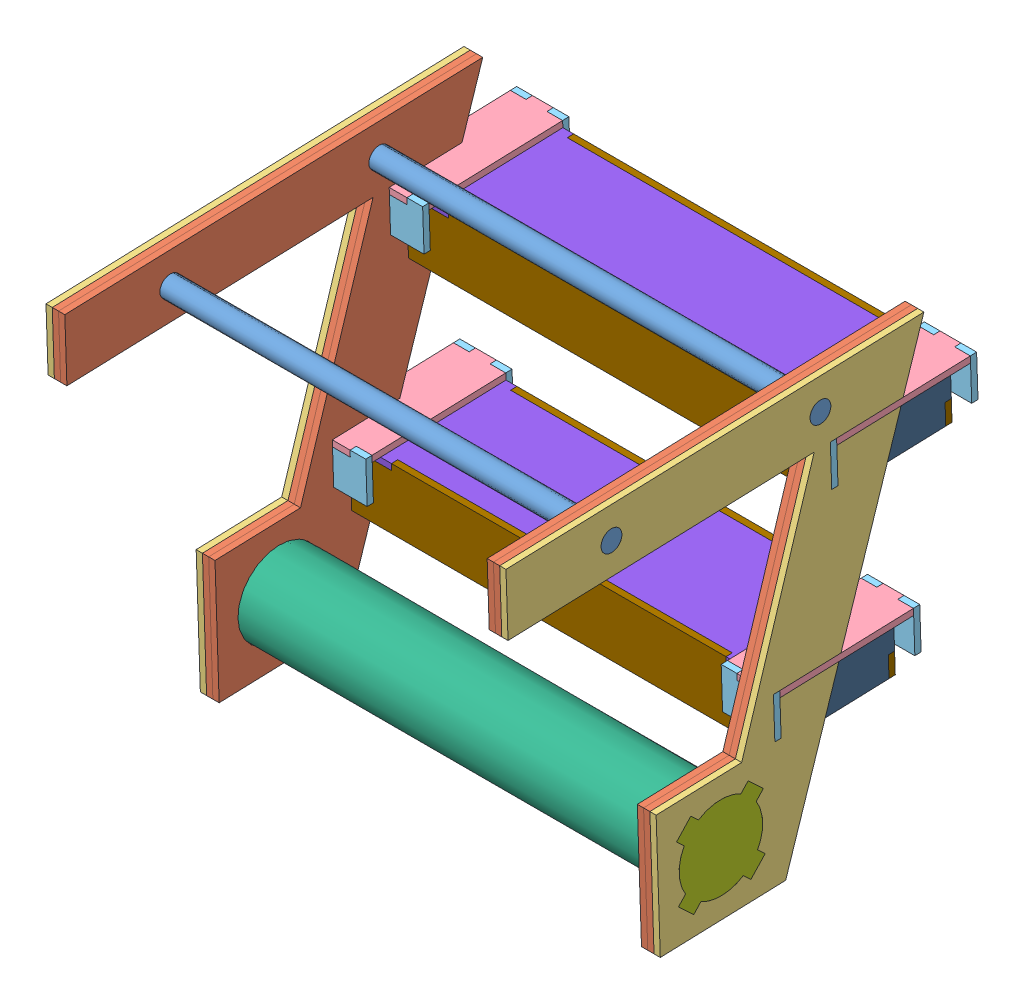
SolidWorks assembly Assem1.SLDASM, configuration Default (file format 4700). Lengths in mm.
Overall size (220 206.57 225.77).
39 component instances, 12 part files, 122 mates.
Components (placement in the parent):
- rod-1: rod.SLDPRT [Default] at (-97.6278 -12.454 6.6816) size (220 10 10)
- Wood-1: Wood.SLDPRT [Default] at (-91.6278 -71.57 -4.8306) x (1 0 0) z (0 0.033234 -0.999448) size (3 200.03 200.01)
- Middle Acrylic-1: Middle Acrylic.SLDPRT [Default] at (-97.6278 -84.7118 -25.1655) x (1 0 0) z (0 0.033234 -0.999448) size (3 200.03 200.01)
- Wood-2: Wood.SLDPRT [Default] at (-94.6278 -71.57 -4.8306) x (1 0 0) z (0 0.033234 -0.999448) size (3 200.03 200.01)
- slider 2-1: slider 2.SLDPRT [Default] at (-104.8226 -113.9 -101.9414) x (0 -0.033234 0.999448) z (1 0 0) size (70 3 25)
- slider 1-1: slider 1.SLDPRT [Default] at (-104.5848 -124.3919 -74.1037) x (0 -0.033234 0.999448) z (1 0 0) size (3 20 25)
- slider 1-2: slider 1.SLDPRT [Default] at (-104.5848 -122.1652 -141.0667) x (0 -0.033234 0.999448) z (1 0 0) size (3 20 25)
- slider 2-3: slider 2.SLDPRT [Default] at (-65.4329 -22.6911 -136.8006) x (0 0.033234 -0.999448) z (-1 0 0) size (70 3 25)
- slider 1-4: slider 1.SLDPRT [Default] at (-65.6707 -31.3105 -165.2738) x (0 0.033234 -0.999448) z (-1 0 0) size (3 20 25)
- slider 1-5: slider 1.SLDPRT [Default] at (-65.6707 -33.5372 -98.3108) x (0 0.033234 -0.999448) z (-1 0 0) size (3 20 25)
- rod-2: rod.SLDPRT [Default] at (-97.6278 -9.1306 -93.2632) size (220 10 10)
- Wood-3: Wood.SLDPRT [Default] at (113.3722 -71.57 -4.8306) x (1 0 0) z (0 0.033234 -0.999448) size (3 200.03 200.01)
- Wood-4: Wood.SLDPRT [Default] at (116.3722 -71.57 -4.8306) x (1 0 0) z (0 0.033234 -0.999448) size (3 200.03 200.01)
- Middle Acrylic-2: Middle Acrylic.SLDPRT [Default] at (119.3722 -84.7118 -25.1655) x (1 0 0) z (0 0.033234 -0.999448) size (3 200.03 200.01)
- slider 1-6: slider 1.SLDPRT [Default] at (90.4152 -33.4375 -101.3092) x (0 -0.033234 0.999448) z (1 0 0) size (3 20 25)
- slider 2-4: slider 2.SLDPRT [Default] at (90.1774 -22.9456 -129.1469) x (0 -0.033234 0.999448) z (1 0 0) size (70 3 25)
- slider 1-7: slider 1.SLDPRT [Default] at (129.3293 -122.2649 -138.0683) x (0 0.033234 -0.999448) z (-1 0 0) size (3 20 25)
- slider 2-5: slider 2.SLDPRT [Default] at (129.5671 -113.6455 -109.5951) x (0 0.033234 -0.999448) z (-1 0 0) size (70 3 25)
- slider 1-8: slider 1.SLDPRT [Default] at (90.4152 -31.2108 -168.2721) x (0 -0.033234 0.999448) z (1 0 0) size (3 20 25)
- slider 1-9: slider 1.SLDPRT [Default] at (129.3293 -124.4916 -71.1054) x (0 0.033234 -0.999448) z (-1 0 0) size (3 20 25)
- Part2-1: Part2.SLDPRT [Default] at (-94.6278 -165.8298 -45.6506) x (1 0 0) z (0 0.985766 -0.168122) size (214 40 40)
- Part3-1: Part3.SLDPRT [Default] at (119.3722 -180.9635 -97.3704) x (1 0 0) z (0 0.033234 -0.999448) size (3 41.53 41.53)
- Part3-2: Part3.SLDPRT [Default] at (-97.6278 -180.9635 -97.3704) x (1 0 0) z (0 0.033234 -0.999448) size (3 41.53 41.53)
- box segment 1-1: box segment 1.SLDPRT [Default] at (62.9184 -120.6489 10.7487) x (1 0 0) z (0 0.033234 -0.999448) size (200 3 60)
- box segment 2-1: box segment 2.SLDPRT [Default] at (36.6837 -131.3951 -135.3703) x (0 0.033234 -0.999448) z (-1 0 0) size (3 30 200)
- box segment 2-2: box segment 2.SLDPRT [Default] at (-11.5352 -133.1897 -81.4001) x (0 -0.033234 0.999448) z (1 0 0) size (3 30 200)
- box segment 3-1: box segment 3.SLDPRT [Default] at (109.5742 -168.1834 -47.1865) x (0 -0.033234 0.999448) z (1 0 0) size (60 30 3)
- box segment 3-2: box segment 3.SLDPRT [Default] at (-87.4258 -168.1834 -47.1865) x (0 -0.033234 0.999448) z (1 0 0) size (60 30 3)
- inside box-1: inside box.SLDPRT [Default] at (53.7713 -133.098 -156.4829) x (1 0 0) z (0 -0.033234 0.999448) size (194 3 54)
- foundation in box-1: foundation in box.SLDPRT [Default] at (101.5742 -125.6678 -167.5938) x (1 0 0) z (0 -0.033234 0.999448) size (3 15 54)
- foundation in box-2: foundation in box.SLDPRT [Default] at (-79.4258 -125.6678 -167.5938) x (1 0 0) z (0 -0.033234 0.999448) size (3 15 54)
- box segment 1-2: box segment 1.SLDPRT [Default] at (62.8512 -29.6945 -16.4567) x (1 0 0) z (0 0.033234 -0.999448) size (200 3 60)
- box segment 3-3: box segment 3.SLDPRT [Default] at (109.507 -77.229 -74.392) x (0 -0.033234 0.999448) z (1 0 0) size (60 30 3)
- box segment 3-4: box segment 3.SLDPRT [Default] at (-87.493 -77.229 -74.392) x (0 -0.033234 0.999448) z (1 0 0) size (60 30 3)
- box segment 2-3: box segment 2.SLDPRT [Default] at (-11.6024 -42.2353 -108.6056) x (0 -0.033234 0.999448) z (1 0 0) size (3 30 200)
- box segment 2-4: box segment 2.SLDPRT [Default] at (36.6165 -40.4407 -162.5757) x (0 0.033234 -0.999448) z (-1 0 0) size (3 30 200)
- inside box-2: inside box.SLDPRT [Default] at (53.7041 -42.1436 -183.6883) x (1 0 0) z (0 -0.033234 0.999448) size (194 3 54)
- foundation in box-3: foundation in box.SLDPRT [Default] at (101.507 -34.7134 -194.7992) x (1 0 0) z (0 -0.033234 0.999448) size (3 15 54)
- foundation in box-4: foundation in box.SLDPRT [Default] at (-79.493 -34.7134 -194.7992) x (1 0 0) z (0 -0.033234 0.999448) size (3 15 54)
Mates (geometry in assembly coordinates):
- Concentric1: concentric aligned: cylinder of rod-1 through (122.3722 -12.454 6.6816) axis (-1 0 0) radius 5; cylinder of Wood-1 through (-88.6278 -12.454 6.6816) axis (-1 0 0) radius 5
- Concentric2: concentric aligned: cylinder of rod-1 through (122.3722 -12.454 6.6816) axis (-1 0 0) radius 5; cylinder of Wood-2 through (-91.6278 -12.454 6.6816) axis (-1 0 0) radius 5
- Coincident1: coincident anti-aligned: plane of Wood-1 through (-91.6278 0.8761 57.1524) normal (-1 0 0); plane of Wood-2 through (-91.6278 0.8761 57.1524) normal (1 0 0)
- Concentric3: concentric aligned: cylinder of rod-1 through (122.3722 -12.454 6.6816) axis (-1 0 0) radius 5; cylinder of Middle Acrylic-1 through (-94.6278 -12.454 6.6816) axis (-1 0 0) radius 5
- Coincident3: coincident anti-aligned: plane of Middle Acrylic-1 through (-94.6278 0.8761 57.1524) normal (1 0 0); plane of Wood-2 through (-94.6278 0.8761 57.1524) normal (-1 0 0)
- Coincident4: coincident anti-aligned: plane of slider 2-1 through (-80.1278 -117.8346 -73.8857) normal (0 -0.999448 -0.033234); plane of slider 1-2 through (-80.1278 -115.7076 -137.8503) normal (0 0.999448 0.033234)
- Coincident5: coincident aligned: plane of slider 2-1 through (-80.1278 -114.8363 -73.7859) normal (0 0.999448 0.033234); plane of slider 1-2 through (-90.1278 -112.7093 -137.7506) normal (0 0.999448 0.033234)
- Coincident6: coincident: plane of slider 1-2 through (-90.1278 -112.7093 -137.7506) normal (1 0 0); line of slider 2-1 through (-90.1278 -115.6079 -140.8486) axis (0 0.999448 0.033234)
- Coincident7: coincident anti-aligned: plane of slider 1-2 through (-90.1278 -112.7093 -137.7506) normal (1 0 0); plane of slider 2-1 through (-90.1278 -115.7076 -137.8503) normal (-1 0 0)
- Coincident8: coincident aligned: plane of slider 1-2 through (-72.6278 -112.6096 -140.7489) normal (0 0.033234 -0.999448); plane of slider 2-1 through (-90.1278 -115.6079 -140.8486) normal (0 0.033234 -0.999448)
- Coincident9: coincident aligned: plane of slider 1-1 through (-72.6278 -114.936 -70.7876) normal (0 -0.033234 0.999448); plane of slider 2-1 through (-90.1278 -117.9343 -70.8873) normal (0 -0.033234 0.999448)
- Coincident10: coincident aligned: plane of slider 1-1 through (-72.6278 -134.9249 -71.4523) normal (1 0 0); plane of slider 2-1 through (-72.6278 -115.7076 -137.8503) normal (1 0 0)
- Coincident14: coincident anti-aligned: plane of slider 2-1 through (-80.1278 -117.9343 -70.8873) normal (1 0 0); plane of slider 1-1 through (-80.1278 -114.936 -70.7876) normal (-1 0 0)
- Coincident15: coincident anti-aligned: line of slider 2-1 through (-72.6278 -112.7093 -137.7506) axis (0 -0.033234 0.999448); line of slider 1-1 through (-72.6278 -114.936 -70.7876) axis (0 0.033234 -0.999448)
- Coincident16: coincident aligned: plane of Middle Acrylic-1 through (-94.6278 -134.9249 -71.4523) normal (0 0.033234 -0.999448); plane of Wood-2 through (-91.6278 -134.9249 -71.4523) normal (0 0.033234 -0.999448)
- Coincident17: coincident aligned: plane of Wood-1 through (-88.6278 -134.9249 -71.4523) normal (0 0.033234 -0.999448); plane of Wood-2 through (-91.6278 -134.9249 -71.4523) normal (0 0.033234 -0.999448)
- Coincident20: coincident anti-aligned: plane of Middle Acrylic-1 through (-94.6278 -114.936 -70.7876) normal (0 -0.999448 -0.033234); plane of slider 2-1 through (-80.1278 -114.8363 -73.7859) normal (0 0.999448 0.033234)
- Coincident22: coincident aligned: plane of Middle Acrylic-1 through (-97.6278 0.8761 57.1524) normal (-1 0 0); plane of slider 1-1 through (-97.6278 -134.9249 -71.4523) normal (-1 0 0)
- Coincident23: coincident anti-aligned: plane of Middle Acrylic-1 through (-94.6278 -134.9249 -71.4523) normal (0 0.033234 -0.999448); plane of slider 1-1 through (-72.6278 -114.936 -70.7876) normal (0 -0.033234 0.999448)
- Coincident24: coincident aligned: plane of rod-1 through (-97.6278 -12.454 6.6816) normal (-1 0 0); plane of Middle Acrylic-1 through (-97.6278 0.8761 57.1524) normal (-1 0 0)
- Coincident25: coincident aligned: plane of slider 2-3 through (-80.1278 -26.9799 -98.0928) normal (0 -0.033234 0.999448); plane of slider 1-5 through (-97.6278 -23.9816 -97.9931) normal (0 -0.033234 0.999448)
- Coincident26: coincident anti-aligned: plane of slider 2-3 through (-90.1278 -24.7532 -165.0558) normal (0 -0.999448 -0.033234); plane of slider 1-5 through (-90.1278 -26.8802 -101.0911) normal (0 0.999448 0.033234)
- Coincident27: coincident aligned: plane of slider 2-3 through (-97.6278 -26.8802 -101.0911) normal (-1 0 0); plane of slider 1-5 through (-97.6278 -43.8708 -101.6561) normal (-1 0 0)
- Coincident28: coincident anti-aligned: plane of slider 2-3 through (-97.6278 -24.7532 -165.0558) normal (0 0.033234 -0.999448); plane of slider 1-4 through (-97.6278 -21.7549 -164.9561) normal (0 -0.033234 0.999448)
- Coincident29: coincident anti-aligned: plane of slider 2-3 through (-90.1278 -24.7532 -165.0558) normal (0 -0.999448 -0.033234); plane of slider 1-4 through (-90.1278 -24.6535 -168.0541) normal (0 0.999448 0.033234)
- Coincident30: coincident aligned: plane of slider 2-3 through (-72.6278 -26.8802 -101.0911) normal (1 0 0); plane of slider 1-4 through (-72.6278 -41.6442 -168.6191) normal (1 0 0)
- Coincident31: coincident anti-aligned: plane of Middle Acrylic-1 through (-94.6278 -23.9816 -97.9931) normal (0 0.033234 -0.999448); plane of slider 1-5 through (-97.6278 -23.9816 -97.9931) normal (0 -0.033234 0.999448)
- Coincident32: coincident aligned: plane of Middle Acrylic-1 through (-97.6278 0.8761 57.1524) normal (-1 0 0); plane of slider 1-5 through (-97.6278 -43.8708 -101.6561) normal (-1 0 0)
- Coincident33: coincident anti-aligned: plane of Middle Acrylic-1 through (-94.6278 -23.9816 -97.9931) normal (0 -0.999448 -0.033234); plane of slider 2-3 through (-90.1278 -21.7549 -164.9561) normal (0 0.999448 0.033234)
- Coincident34: coincident aligned: plane of Middle Acrylic-1 through (-97.6278 0.8761 57.1524) normal (-1 0 0); plane of rod-2 through (-97.6278 -9.1306 -93.2632) normal (-1 0 0)
- Concentric4: concentric aligned: cylinder of Middle Acrylic-1 through (-94.6278 -9.1306 -93.2632) axis (-1 0 0) radius 5; cylinder of rod-2 through (122.3722 -9.1306 -93.2632) axis (-1 0 0) radius 5
- Concentric5: concentric aligned: cylinder of rod-2 through (122.3722 -9.1306 -93.2632) axis (-1 0 0) radius 5; cylinder of Wood-3 through (116.3722 -9.1306 -93.2632) axis (-1 0 0) radius 5
- Coincident35: coincident anti-aligned: cylinder of rod-2 through (122.3722 -9.1306 -93.2632) axis (-1 0 0) radius 5; circle of Wood-4
- Concentric6: concentric aligned: cylinder of rod-2 through (122.3722 -9.1306 -93.2632) axis (-1 0 0) radius 5; cylinder of Middle Acrylic-2 through (122.3722 -9.1306 -93.2632) axis (-1 0 0) radius 5
- Coincident36: coincident anti-aligned: plane of Wood-3 through (116.3722 0.8761 57.1524) normal (1 0 0); plane of Wood-4 through (116.3722 0.8761 57.1524) normal (-1 0 0)
- Coincident37: coincident anti-aligned: plane of Wood-4 through (119.3722 0.8761 57.1524) normal (1 0 0); plane of Middle Acrylic-2 through (119.3722 0.8761 57.1524) normal (-1 0 0)
- Concentric7: concentric aligned: cylinder of rod-1 through (122.3722 -12.454 6.6816) axis (-1 0 0) radius 5; cylinder of Wood-3 through (116.3722 -12.454 6.6816) axis (-1 0 0) radius 5
- Concentric8: concentric aligned: cylinder of rod-1 through (122.3722 -12.454 6.6816) axis (-1 0 0) radius 5; cylinder of Wood-4 through (119.3722 -12.454 6.6816) axis (-1 0 0) radius 5
- Coincident38: coincident anti-aligned: cylinder of rod-1 through (122.3722 -12.454 6.6816) axis (-1 0 0) radius 5; circle of Middle Acrylic-2
- Coincident39: coincident aligned: circle of rod-2; plane of Middle Acrylic-2 through (122.3722 0.8761 57.1524) normal (1 0 0)
- Coincident40: coincident aligned: plane of slider 2-5 through (97.3722 -117.8346 -73.8857) normal (-1 0 0); plane of slider 1-9 through (97.3722 -134.8252 -74.4506) normal (-1 0 0)
- Coincident41: coincident aligned: plane of slider 1-7 through (97.3722 -132.5985 -141.4136) normal (-1 0 0); plane of slider 2-5 through (97.3722 -117.8346 -73.8857) normal (-1 0 0)
- Coincident42: coincident aligned: plane of slider 2-4 through (122.3722 -24.7532 -165.0558) normal (1 0 0); plane of slider 1-8 through (122.3722 -41.7439 -165.6207) normal (1 0 0)
- Coincident43: coincident aligned: plane of slider 1-6 through (122.3722 -43.9705 -98.6577) normal (1 0 0); plane of slider 2-4 through (122.3722 -24.7532 -165.0558) normal (1 0 0)
- Coincident44: coincident aligned: plane of slider 1-7 through (97.3722 -132.5985 -141.4136) normal (-1 0 0); plane of slider 2-5 through (97.3722 -117.8346 -73.8857) normal (-1 0 0)
- Coincident45: coincident aligned: plane of slider 2-5 through (114.8722 -117.9343 -70.8873) normal (0 -0.033234 0.999448); plane of slider 1-9 through (97.3722 -114.936 -70.7876) normal (0 -0.033234 0.999448)
- Coincident46: coincident aligned: plane of slider 1-7 through (97.3722 -112.6096 -140.7489) normal (0 0.033234 -0.999448); plane of slider 2-5 through (114.8722 -115.6079 -140.8486) normal (0 0.033234 -0.999448)
- Coincident47: coincident aligned: plane of slider 1-6 through (122.3722 -23.9816 -97.9931) normal (0 -0.033234 0.999448); plane of slider 2-4 through (104.8722 -26.9799 -98.0928) normal (0 -0.033234 0.999448)
- Coincident48: coincident aligned: plane of slider 2-4 through (104.8722 -24.6535 -168.0541) normal (0 0.033234 -0.999448); plane of slider 1-8 through (122.3722 -21.6552 -167.9544) normal (0 0.033234 -0.999448)
- Coincident49: coincident aligned: plane of slider 2-4 through (114.8722 -23.8819 -100.9914) normal (0 0.999448 0.033234); plane of slider 1-8 through (122.3722 -21.7549 -164.9561) normal (0 0.999448 0.033234)
- Coincident50: coincident aligned: plane of slider 1-6 through (122.3722 -43.9705 -98.6577) normal (1 0 0); plane of slider 2-4 through (122.3722 -24.7532 -165.0558) normal (1 0 0)
- Coincident51: coincident aligned: plane of slider 1-6 through (122.3722 -23.9816 -97.9931) normal (0 0.999448 0.033234); plane of slider 2-4 through (114.8722 -23.8819 -100.9914) normal (0 0.999448 0.033234)
- Coincident53: coincident aligned: plane of slider 1-7 through (97.3722 -112.6096 -140.7489) normal (0 0.999448 0.033234); plane of slider 2-5 through (104.8722 -112.7093 -137.7506) normal (0 0.999448 0.033234)
- Coincident54: coincident aligned: plane of slider 2-5 through (104.8722 -112.7093 -137.7506) normal (0 0.999448 0.033234); plane of slider 1-9 through (97.3722 -114.8363 -73.7859) normal (0 0.999448 0.033234)
- Coincident55: coincident anti-aligned: plane of Wood-3 through (116.3722 -134.9249 -71.4523) normal (0 0.033234 -0.999448); plane of slider 1-9 through (97.3722 -114.936 -70.7876) normal (0 -0.033234 0.999448)
- Coincident57: coincident aligned: plane of Middle Acrylic-2 through (122.3722 0.8761 57.1524) normal (1 0 0); plane of slider 2-5 through (122.3722 -117.8346 -73.8857) normal (1 0 0)
- Coincident58: coincident anti-aligned: plane of Middle Acrylic-2 through (122.3722 -114.936 -70.7876) normal (0 -0.999448 -0.033234); plane of slider 2-5 through (104.8722 -112.7093 -137.7506) normal (0 0.999448 0.033234)
- Coincident59: coincident anti-aligned: plane of Middle Acrylic-2 through (122.3722 -23.9816 -97.9931) normal (0 0.033234 -0.999448); plane of slider 1-6 through (122.3722 -23.9816 -97.9931) normal (0 -0.033234 0.999448)
- Coincident60: coincident aligned: plane of Middle Acrylic-2 through (122.3722 0.8761 57.1524) normal (1 0 0); plane of slider 1-8 through (122.3722 -41.7439 -165.6207) normal (1 0 0)
- Coincident61: coincident: line of Wood-4 through (119.3722 -23.9816 -97.9931) axis (0 0.033234 -0.999448); plane of slider 2-4 through (114.8722 -23.8819 -100.9914) normal (0 0.999448 0.033234)
- Coincident62: coincident anti-aligned: plane of Part2-1 through (-94.6278 -165.8298 -45.6506) normal (-1 0 0); plane of Part3-2 through (-94.6278 -165.8298 -45.6506) normal (1 0 0)
- Coincident63: coincident aligned: circle of Part2-1; circle of Part3-2
- Coincident64: coincident aligned: plane of Middle Acrylic-1 through (-97.6278 0.8761 57.1524) normal (-1 0 0); plane of Part3-2 through (-97.6278 -165.8298 -45.6506) normal (-1 0 0)
- Coincident65: coincident anti-aligned: plane of Middle Acrylic-1 through (-94.6278 -144.622 -58.646) normal (0 -0.730216 0.683216); plane of Part3-2 through (-94.6278 -144.622 -58.646) normal (0 0.730216 -0.683216)
- Coincident66: coincident anti-aligned: plane of Middle Acrylic-1 through (-94.6278 -152.8344 -24.4429) normal (0 -0.683216 -0.730216); plane of Part3-2 through (-94.6278 -152.8344 -24.4429) normal (0 0.683216 0.730216)
- Coincident67: coincident anti-aligned: plane of Part2-1 through (119.3722 -165.8298 -45.6506) normal (1 0 0); plane of Part3-1 through (119.3722 -165.8298 -45.6506) normal (-1 0 0)
- Coincident68: coincident anti-aligned: plane of Middle Acrylic-2 through (122.3722 -144.622 -58.646) normal (0 -0.730216 0.683216); plane of Part3-1 through (122.3722 -144.622 -58.646) normal (0 0.730216 -0.683216)
- Coincident69: coincident anti-aligned: plane of Middle Acrylic-2 through (122.3722 -151.4542 -65.9482) normal (0 0.683216 0.730216); plane of Part3-1 through (122.3722 -155.1053 -62.5321) normal (0 -0.683216 -0.730216)
- Coincident97: coincident aligned: plane of box segment 1-1 through (92.5742 -115.8073 -134.852) normal (0 0.999448 0.033234); plane of box segment 3-1 through (112.5742 -116.5385 -112.8641) normal (0 0.999448 0.033234)
- Coincident98: coincident anti-aligned: plane of box segment 1-1 through (92.5742 -118.8057 -134.9517) normal (0 -0.999448 -0.033234); plane of box segment 3-1 through (112.5742 -118.8057 -134.9517) normal (0 0.999448 0.033234)
- Coincident99: coincident anti-aligned: plane of box segment 1-1 through (92.5742 -118.8057 -134.9517) normal (0 -0.999448 -0.033234); plane of box segment 3-1 through (112.5742 -118.8057 -134.9517) normal (0 0.999448 0.033234)
- Coincident100: coincident aligned: plane of box segment 1-1 through (92.5742 -115.8073 -134.852) normal (0 0.999448 0.033234); plane of box segment 3-1 through (112.5742 -116.5385 -112.8641) normal (0 0.999448 0.033234)
- Coincident101: coincident anti-aligned: plane of box segment 1-1 through (109.5742 -119.5368 -112.9638) normal (0 -0.033234 0.999448); plane of box segment 3-1 through (112.5742 -119.5368 -112.9638) normal (0 0.033234 -0.999448)
- Coincident102: coincident anti-aligned: plane of box segment 1-1 through (109.5742 -119.8692 -102.9693) normal (1 0 0); plane of box segment 3-1 through (109.5742 -137.5909 -81.5465) normal (-1 0 0)
- Coincident103: coincident anti-aligned: plane of box segment 1-1 through (-84.4258 -119.8692 -102.9693) normal (0 0.033234 -0.999448); plane of box segment 3-2 through (-84.4258 -119.8692 -102.9693) normal (0 -0.033234 0.999448)
- Coincident104: coincident anti-aligned: plane of box segment 1-1 through (-84.4258 -119.8692 -102.9693) normal (-1 0 0); plane of box segment 3-2 through (-84.4258 -137.5909 -81.5465) normal (1 0 0)
- Coincident105: coincident aligned: plane of box segment 1-1 through (92.5742 -115.8073 -134.852) normal (0 0.999448 0.033234); plane of box segment 3-2 through (-84.4258 -116.5385 -112.8641) normal (0 0.999448 0.033234)
- Coincident106: coincident anti-aligned: plane of box segment 2-1 through (-84.4258 -135.6966 -138.515) normal (-1 0 0); plane of box segment 3-2 through (-84.4258 -137.5909 -81.5465) normal (1 0 0)
- Coincident107: coincident anti-aligned: plane of box segment 2-2 through (-84.4258 -137.6906 -78.5481) normal (-1 0 0); plane of box segment 3-2 through (-84.4258 -137.5909 -81.5465) normal (1 0 0)
- Coincident108: coincident: plane of box segment 1-1 through (92.5742 -118.8057 -134.9517) normal (0 -0.999448 -0.033234); line of box segment 2-2 through (112.5742 -120.7 -77.9831) axis (-1 0 0)
- Coincident109: coincident anti-aligned: plane of box segment 1-1 through (92.5742 -118.8057 -134.9517) normal (0 -0.999448 -0.033234); plane of box segment 2-1 through (112.5742 -118.706 -137.95) normal (0 0.999448 0.033234)
- Coincident110: coincident aligned: plane of box segment 1-1 through (92.5742 -115.8073 -134.852) normal (0 0.999448 0.033234); plane of box segment 2-1 through (-67.4258 -115.7076 -137.8503) normal (0 0.999448 0.033234)
- Coincident111: coincident aligned: plane of box segment 1-1 through (112.5742 -118.706 -137.95) normal (0 0.033234 -0.999448); plane of box segment 2-1 through (112.5742 -135.6966 -138.515) normal (0 0.033234 -0.999448)
- Coincident112: coincident aligned: plane of box segment 1-1 through (92.5742 -120.7 -77.9831) normal (0 -0.033234 0.999448); plane of box segment 2-2 through (-87.4258 -137.6906 -78.5481) normal (0 -0.033234 0.999448)
- Coincident113: coincident anti-aligned: plane of slider 2-1 through (-80.1278 -117.8346 -73.8857) normal (0 -0.999448 -0.033234); plane of box segment 1-1 through (92.5742 -115.8073 -134.852) normal (0 0.999448 0.033234)
- Coincident114: coincident anti-aligned: plane of slider 1-2 through (-72.6278 -112.7093 -137.7506) normal (0 -0.033234 0.999448); plane of box segment 2-1 through (112.5742 -135.6966 -138.515) normal (0 0.033234 -0.999448)
- Coincident130: coincident aligned: plane of inside box-1 through (-84.4258 -135.592 -81.48) normal (0 -0.999448 -0.033234); plane of foundation in box-2 through (-76.4258 -134.3624 -118.4596) normal (0 -0.999448 -0.033234)
- Coincident131: coincident anti-aligned: plane of inside box-1 through (-76.4258 -131.364 -118.3599) normal (0 -0.033234 0.999448); plane of foundation in box-2 through (-76.4258 -134.3624 -118.4596) normal (0 0.033234 -0.999448)
- Coincident132: coincident anti-aligned: plane of inside box-1 through (-76.4258 -131.364 -118.3599) normal (-1 0 0); plane of foundation in box-2 through (-76.4258 -118.8057 -134.9517) normal (1 0 0)
- Coincident133: coincident aligned: plane of inside box-1 through (-84.4258 -135.592 -81.48) normal (0 -0.999448 -0.033234); plane of foundation in box-1 through (104.5742 -134.3624 -118.4596) normal (0 -0.999448 -0.033234)
- Coincident135: coincident anti-aligned: plane of inside box-1 through (101.5742 -131.364 -118.3599) normal (0 -0.033234 0.999448); plane of foundation in box-1 through (104.5742 -134.3624 -118.4596) normal (0 0.033234 -0.999448)
- Coincident136: coincident anti-aligned: plane of inside box-1 through (101.5742 -131.364 -118.3599) normal (1 0 0); plane of foundation in box-1 through (101.5742 -118.8057 -134.9517) normal (-1 0 0)
- Coincident137: coincident anti-aligned: plane of box segment 1-1 through (92.5742 -118.8057 -134.9517) normal (0 -0.999448 -0.033234); plane of foundation in box-2 through (-76.4258 -118.8057 -134.9517) normal (0 0.999448 0.033234)
- Coincident138: coincident anti-aligned: plane of box segment 3-2 through (-84.4258 -137.5909 -81.5465) normal (1 0 0); plane of inside box-1 through (-84.4258 -130.7991 -135.3505) normal (-1 0 0)
- Coincident139: coincident anti-aligned: plane of box segment 2-2 through (-87.4258 -137.5909 -81.5465) normal (0 0.033234 -0.999448); plane of inside box-1 through (-84.4258 -132.5937 -81.3803) normal (0 -0.033234 0.999448)
- Coincident140: coincident anti-aligned: plane of box segment 1-2 through (-67.493 -29.6459 -108.1869) normal (1 0 0); plane of box segment 2-3 through (-67.493 -26.7473 -105.0889) normal (-1 0 0)
- Coincident141: coincident anti-aligned: plane of box segment 1-2 through (92.507 -29.6459 -108.1869) normal (-1 0 0); plane of box segment 2-3 through (92.507 -26.7473 -105.0889) normal (1 0 0)
- Coincident142: coincident aligned: plane of box segment 1-2 through (92.507 -24.853 -162.0574) normal (0 0.999448 0.033234); plane of box segment 2-3 through (92.507 -26.7473 -105.0889) normal (0 0.999448 0.033234)
- Coincident143: coincident anti-aligned: plane of box segment 1-2 through (92.507 -29.6459 -108.1869) normal (0 -0.033234 0.999448); plane of box segment 2-3 through (-87.493 -46.6365 -108.7519) normal (0 0.033234 -0.999448)
- Coincident144: coincident anti-aligned: plane of box segment 1-2 through (109.507 -28.5824 -140.1693) normal (0 -0.033234 0.999448); plane of box segment 3-3 through (112.507 -28.5824 -140.1693) normal (0 0.033234 -0.999448)
- Coincident145: coincident aligned: plane of box segment 1-2 through (92.507 -24.853 -162.0574) normal (0 0.999448 0.033234); plane of box segment 3-3 through (112.507 -25.5841 -140.0696) normal (0 0.999448 0.033234)
- Coincident146: coincident anti-aligned: plane of box segment 1-2 through (109.507 -28.9148 -130.1748) normal (1 0 0); plane of box segment 3-3 through (109.507 -46.6365 -108.7519) normal (-1 0 0)
- Coincident147: coincident aligned: plane of box segment 1-2 through (92.507 -24.853 -162.0574) normal (0 0.999448 0.033234); plane of box segment 3-4 through (-84.493 -25.5841 -140.0696) normal (0 0.999448 0.033234)
- Coincident148: coincident anti-aligned: plane of box segment 1-2 through (-87.493 -28.5824 -140.1693) normal (0 -0.033234 0.999448); plane of box segment 3-4 through (-84.493 -28.5824 -140.1693) normal (0 0.033234 -0.999448)
- Coincident149: coincident anti-aligned: plane of box segment 1-2 through (-84.493 -28.9148 -130.1748) normal (-1 0 0); plane of box segment 3-4 through (-84.493 -46.6365 -108.7519) normal (1 0 0)
- Coincident150: coincident anti-aligned: plane of box segment 3-4 through (-84.493 -44.7422 -165.7204) normal (0 -0.999448 -0.033234); plane of box segment 2-4 through (-87.493 -44.7422 -165.7204) normal (0 0.999448 0.033234)
- Coincident151: coincident anti-aligned: plane of box segment 3-4 through (-84.493 -34.7477 -165.3881) normal (0 0.999448 0.033234); plane of box segment 2-4 through (-87.493 -34.7477 -165.3881) normal (0 -0.999448 -0.033234)
- Coincident152: coincident aligned: plane of box segment 3-4 through (-84.493 -44.7422 -165.7204) normal (0 0.033234 -0.999448); plane of box segment 2-4 through (112.507 -44.7422 -165.7204) normal (0 0.033234 -0.999448)
- Coincident153: coincident anti-aligned: plane of box segment 1-2 through (92.507 -27.8513 -162.1571) normal (0 -0.999448 -0.033234); plane of foundation in box-4 through (-76.493 -27.8513 -162.1571) normal (0 0.999448 0.033234)
- Coincident154: coincident anti-aligned: plane of box segment 2-3 through (-87.493 -46.6365 -108.7519) normal (0 0.033234 -0.999448); plane of foundation in box-4 through (-76.493 -41.6393 -108.5858) normal (0 -0.033234 0.999448)
- Coincident155: coincident anti-aligned: plane of box segment 2-3 through (-87.493 -46.6365 -108.7519) normal (0 0.033234 -0.999448); plane of foundation in box-3 through (104.507 -41.6393 -108.5858) normal (0 -0.033234 0.999448)
- Coincident156: coincident anti-aligned: plane of box segment 1-2 through (92.507 -27.8513 -162.1571) normal (0 -0.999448 -0.033234); plane of foundation in box-3 through (104.507 -27.8513 -162.1571) normal (0 0.999448 0.033234)
- Coincident157: coincident anti-aligned: plane of inside box-2 through (101.507 -40.4096 -145.5653) normal (0 -0.033234 0.999448); plane of foundation in box-3 through (104.507 -43.408 -145.665) normal (0 0.033234 -0.999448)
- Coincident158: coincident anti-aligned: plane of inside box-2 through (104.507 -40.4096 -145.5653) normal (-1 0 0); plane of foundation in box-3 through (104.507 -27.8513 -162.1571) normal (1 0 0)
- Coincident159: coincident aligned: plane of inside box-2 through (-84.493 -44.6376 -108.6855) normal (0 -0.999448 -0.033234); plane of foundation in box-3 through (104.507 -43.408 -145.665) normal (0 -0.999448 -0.033234)
- Coincident160: coincident anti-aligned: plane of inside box-2 through (-76.493 -40.4096 -145.5653) normal (0 -0.033234 0.999448); plane of foundation in box-4 through (-76.493 -43.408 -145.665) normal (0 0.033234 -0.999448)
- Coincident161: coincident aligned: plane of inside box-2 through (-84.493 -44.6376 -108.6855) normal (0 -0.999448 -0.033234); plane of foundation in box-4 through (-76.493 -43.408 -145.665) normal (0 -0.999448 -0.033234)
- Coincident162: coincident anti-aligned: plane of inside box-2 through (-76.493 -40.4096 -145.5653) normal (-1 0 0); plane of foundation in box-4 through (-76.493 -27.8513 -162.1571) normal (1 0 0)
- Coincident163: coincident anti-aligned: plane of box segment 3-4 through (-84.493 -46.6365 -108.7519) normal (1 0 0); plane of inside box-2 through (-84.493 -39.8447 -162.5559) normal (-1 0 0)
- Coincident165: coincident aligned: plane of box segment 3-3 through (112.507 -46.6365 -108.7519) normal (1 0 0); plane of box segment 2-4 through (112.507 -54.7367 -166.0528) normal (1 0 0)
- Coincident166: coincident anti-aligned: plane of slider 2-3 through (-90.1278 -24.7532 -165.0558) normal (0 -0.999448 -0.033234); plane of box segment 1-2 through (92.507 -24.853 -162.0574) normal (0 0.999448 0.033234)
- Coincident167: coincident anti-aligned: plane of slider 1-4 through (-97.6278 -21.7549 -164.9561) normal (0 -0.033234 0.999448); plane of box segment 2-4 through (112.507 -44.7422 -165.7204) normal (0 0.033234 -0.999448)
